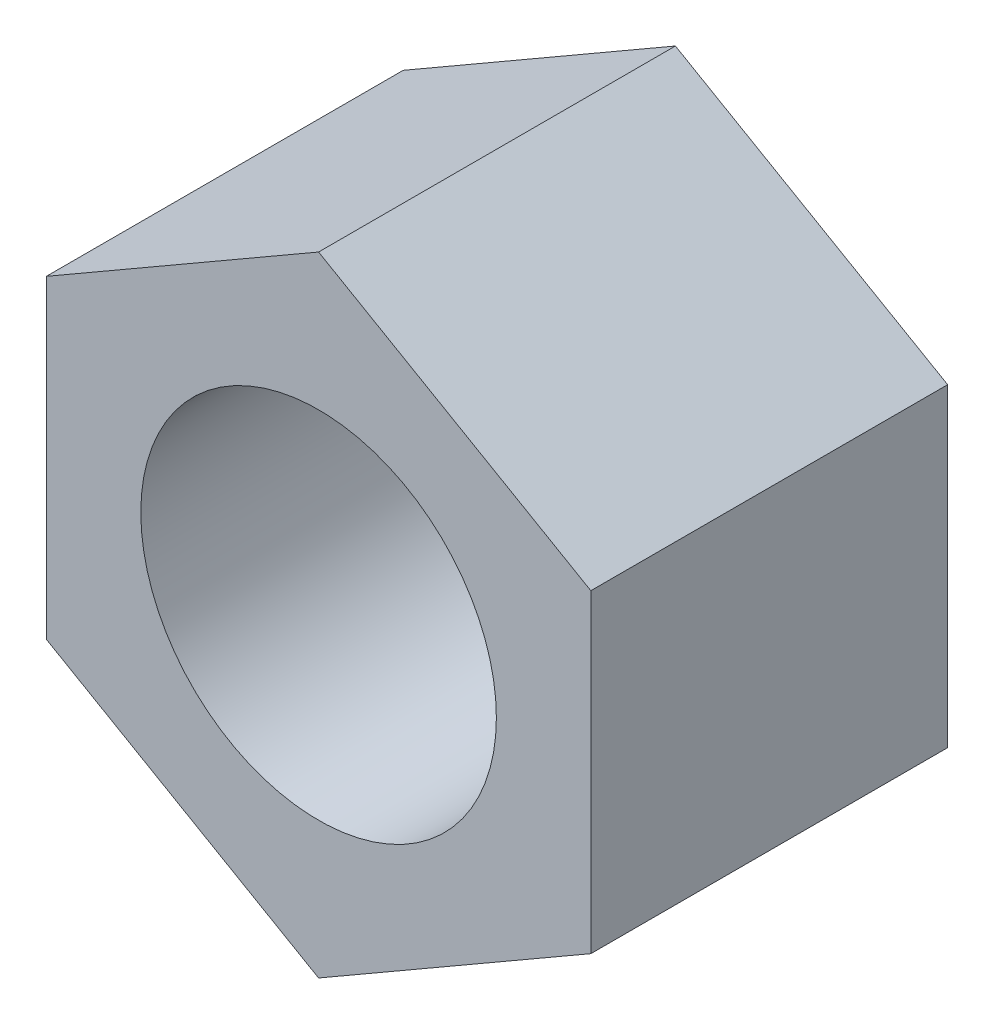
from build123d import *

# Parameters (mm, degrees)
SKETCH1_R      = 50.8
NUT_BODY_DEPTH = 101.9556


with BuildPart() as part:
    # Sketch1 → Nut body (new body)
    with BuildSketch(Plane(origin=(0, 0, 0), x_dir=(0, 1, 0), z_dir=(0, 0, 1))):
        Polygon((89.821268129, 0), (44.910634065, 77.7875), (-44.910634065, 77.7875), (-89.821268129, 0), (-44.910634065, -77.7875), (44.910634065, -77.7875), align=None)
        with Locations(Location((0, 0, 0), (0, 0, 270))):
            Circle(SKETCH1_R, mode=Mode.SUBTRACT)
    extrude(amount=NUT_BODY_DEPTH)


solid = part.part
